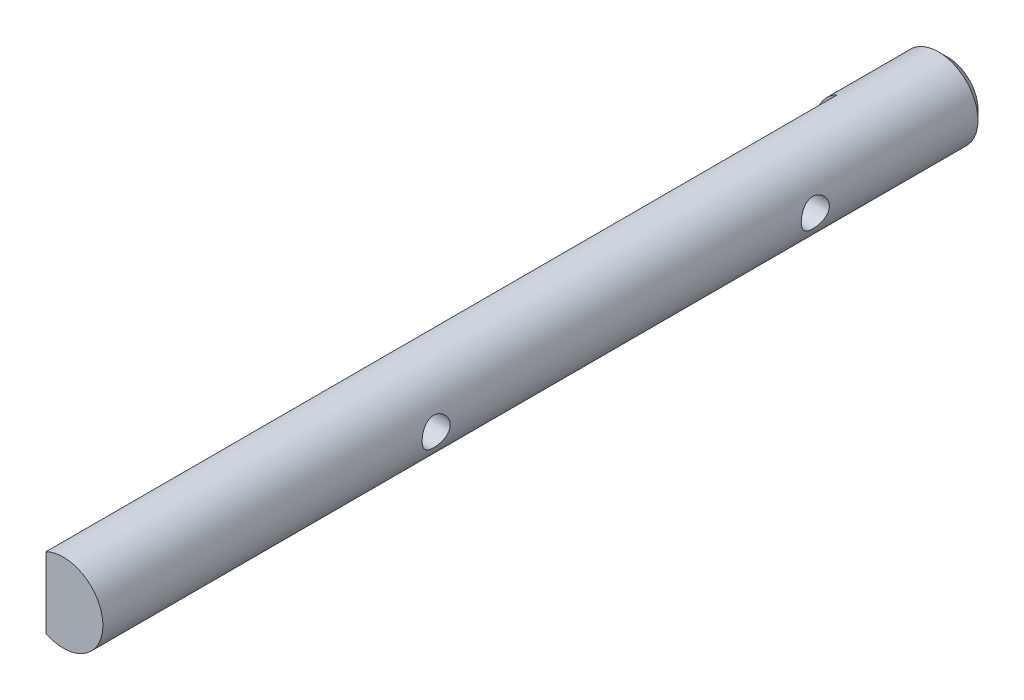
ISO-10303-21;
HEADER;
FILE_DESCRIPTION(('STEP AP214'),'2;1');
FILE_NAME('part.step','',(''),(''),'','','');
FILE_SCHEMA(('AUTOMOTIVE_DESIGN { 1 0 10303 214 1 1 1 1 }'));
ENDSEC;
DATA;
#1=APPLICATION_CONTEXT('core data for automotive mechanical design processes');
#2=APPLICATION_PROTOCOL_DEFINITION('international standard','automotive_design',2000,#1);
#3=PRODUCT_CONTEXT('',#1,'mechanical');
#4=PRODUCT('Part','Part','',(#3));
#5=PRODUCT_RELATED_PRODUCT_CATEGORY('part','',(#4));
#6=PRODUCT_DEFINITION_FORMATION('','',#4);
#7=PRODUCT_DEFINITION_CONTEXT('part definition',#1,'design');
#8=PRODUCT_DEFINITION('design','',#6,#7);
#9=PRODUCT_DEFINITION_SHAPE('','',#8);
#10=(LENGTH_UNIT() NAMED_UNIT(*) SI_UNIT(.MILLI.,.METRE.));
#11=(NAMED_UNIT(*) PLANE_ANGLE_UNIT() SI_UNIT($,.RADIAN.));
#12=(NAMED_UNIT(*) SI_UNIT($,.STERADIAN.) SOLID_ANGLE_UNIT());
#13=UNCERTAINTY_MEASURE_WITH_UNIT(LENGTH_MEASURE(1.E-05),#10,'distance_accuracy_value','');
#14=(GEOMETRIC_REPRESENTATION_CONTEXT(3) GLOBAL_UNCERTAINTY_ASSIGNED_CONTEXT((#13)) GLOBAL_UNIT_ASSIGNED_CONTEXT((#10,
#11,#12)) REPRESENTATION_CONTEXT('',''));
#15=CARTESIAN_POINT('',(0.,0.,0.));
#16=DIRECTION('',(0.,0.,1.));
#17=DIRECTION('',(1.,0.,0.));
#18=AXIS2_PLACEMENT_3D('',#15,#16,#17);
#19=CARTESIAN_POINT('',(0.,0.,160.02));
#20=DIRECTION('',(0.,0.,-1.));
#21=DIRECTION('',(-1.,0.,0.));
#22=AXIS2_PLACEMENT_3D('',#19,#20,#21);
#23=CYLINDRICAL_SURFACE('',#22,3.175);
#24=CARTESIAN_POINT('',(0.,0.,0.761999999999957));
#25=DIRECTION('',(0.,0.,1.));
#26=DIRECTION('',(1.,0.,0.));
#27=AXIS2_PLACEMENT_3D('',#24,#25,#26);
#28=CIRCLE('',#27,3.175);
#29=CARTESIAN_POINT('',(3.175,0.,0.761999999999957));
#30=VERTEX_POINT('',#29);
#31=EDGE_CURVE('E69',#30,#30,#28,.T.);
#32=ORIENTED_EDGE('',*,*,#31,.T.);
#33=EDGE_LOOP('',(#32));
#34=FACE_BOUND('',#33,.T.);
#35=CARTESIAN_POINT('',(3.175,0.,12.7127));
#36=CARTESIAN_POINT('',(3.17500087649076,-0.0614285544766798,12.7126987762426));
#37=CARTESIAN_POINT('',(3.17320130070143,-0.12284839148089,12.7177236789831));
#38=CARTESIAN_POINT('',(3.1662010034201,-0.243864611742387,12.7376185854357));
#39=CARTESIAN_POINT('',(3.16100038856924,-0.30346105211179,12.75248828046));
#40=CARTESIAN_POINT('',(3.14775949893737,-0.41906830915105,12.7914884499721));
#41=CARTESIAN_POINT('',(3.13972436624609,-0.47508540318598,12.8156021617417));
#42=CARTESIAN_POINT('',(3.12162393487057,-0.58227804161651,12.8723250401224));
#43=CARTESIAN_POINT('',(3.11155815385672,-0.633452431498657,12.9049362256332));
#44=CARTESIAN_POINT('',(3.09000790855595,-0.731495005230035,12.9790550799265));
#45=CARTESIAN_POINT('',(3.07848610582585,-0.778149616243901,13.0208343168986));
#46=CARTESIAN_POINT('',(3.055516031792,-0.863958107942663,13.1115265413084));
#47=CARTESIAN_POINT('',(3.04406778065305,-0.903110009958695,13.1604414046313));
#48=CARTESIAN_POINT('',(3.02211785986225,-0.974093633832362,13.266025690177));
#49=CARTESIAN_POINT('',(3.01166094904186,-1.00563502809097,13.3229005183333));
#50=CARTESIAN_POINT('',(2.99345244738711,-1.0586113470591,13.4415793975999));
#51=CARTESIAN_POINT('',(2.98569989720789,-1.0800498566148,13.5033816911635));
#52=CARTESIAN_POINT('',(2.9741742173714,-1.11138819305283,13.6277149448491));
#53=CARTESIAN_POINT('',(2.97026214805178,-1.12169236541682,13.6901306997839));
#54=CARTESIAN_POINT('',(2.96645158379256,-1.13173392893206,13.8159184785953));
#55=CARTESIAN_POINT('',(2.96655163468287,-1.13147514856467,13.8792901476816));
#56=CARTESIAN_POINT('',(2.97063328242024,-1.12070953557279,14.0016133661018));
#57=CARTESIAN_POINT('',(2.9744085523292,-1.11074743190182,14.0606209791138));
#58=CARTESIAN_POINT('',(2.98507483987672,-1.08175290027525,14.1760646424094));
#59=CARTESIAN_POINT('',(2.99196628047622,-1.06271924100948,14.2325003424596));
#60=CARTESIAN_POINT('',(3.00822311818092,-1.01579639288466,14.342367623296));
#61=CARTESIAN_POINT('',(3.01763009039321,-0.987756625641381,14.3957284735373));
#62=CARTESIAN_POINT('',(3.03784253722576,-0.923722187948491,14.497152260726));
#63=CARTESIAN_POINT('',(3.04864845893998,-0.887724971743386,14.5452134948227));
#64=CARTESIAN_POINT('',(3.0712342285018,-0.806247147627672,14.6377112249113));
#65=CARTESIAN_POINT('',(3.08303358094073,-0.760326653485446,14.6817563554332));
#66=CARTESIAN_POINT('',(3.10571393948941,-0.661610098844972,14.761630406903));
#67=CARTESIAN_POINT('',(3.11659483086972,-0.608813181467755,14.797458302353));
#68=CARTESIAN_POINT('',(3.13639217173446,-0.496923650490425,14.8602564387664));
#69=CARTESIAN_POINT('',(3.14528190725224,-0.437759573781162,14.8871083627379));
#70=CARTESIAN_POINT('',(3.15989936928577,-0.315359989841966,14.9303520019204));
#71=CARTESIAN_POINT('',(3.16562835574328,-0.252126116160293,14.9467478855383));
#72=CARTESIAN_POINT('',(3.17306329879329,-0.126684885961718,14.9678894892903));
#73=CARTESIAN_POINT('',(3.17495136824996,-0.0645771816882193,14.9731630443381));
#74=CARTESIAN_POINT('',(3.17504672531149,0.0596565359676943,14.9734316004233));
#75=CARTESIAN_POINT('',(3.1732547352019,0.12178254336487,14.9684286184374));
#76=CARTESIAN_POINT('',(3.16631168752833,0.242087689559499,14.9486955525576));
#77=CARTESIAN_POINT('',(3.16127656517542,0.300329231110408,14.9343009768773));
#78=CARTESIAN_POINT('',(3.14846933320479,0.413538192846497,14.89662458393));
#79=CARTESIAN_POINT('',(3.14069686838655,0.468505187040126,14.8733416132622));
#80=CARTESIAN_POINT('',(3.12292068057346,0.575332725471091,14.8178310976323));
#81=CARTESIAN_POINT('',(3.11286035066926,0.627062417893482,14.785370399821));
#82=CARTESIAN_POINT('',(3.09163517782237,0.724505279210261,14.7126939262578));
#83=CARTESIAN_POINT('',(3.08046995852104,0.770216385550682,14.6724755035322));
#84=CARTESIAN_POINT('',(3.05754963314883,0.8568118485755,14.582951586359));
#85=CARTESIAN_POINT('',(3.0457941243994,0.89732026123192,14.5332816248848));
#86=CARTESIAN_POINT('',(3.02359841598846,0.969488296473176,14.4276058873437));
#87=CARTESIAN_POINT('',(3.01315827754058,1.00114750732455,14.371599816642));
#88=CARTESIAN_POINT('',(2.99485112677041,1.0546547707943,14.2546072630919));
#89=CARTESIAN_POINT('',(2.98698641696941,1.07649405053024,14.1936163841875));
#90=CARTESIAN_POINT('',(2.97489781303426,1.1094694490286,14.0684703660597));
#91=CARTESIAN_POINT('',(2.97067196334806,1.1206113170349,14.0043169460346));
#92=CARTESIAN_POINT('',(2.96658222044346,1.13139068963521,13.8786943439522));
#93=CARTESIAN_POINT('',(2.96647835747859,1.13166111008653,13.8172867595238));
#94=CARTESIAN_POINT('',(2.97003931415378,1.12228164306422,13.6953511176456));
#95=CARTESIAN_POINT('',(2.97370384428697,1.11263251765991,13.6348229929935));
#96=CARTESIAN_POINT('',(2.98419839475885,1.08416089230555,13.5178729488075));
#97=CARTESIAN_POINT('',(2.99094779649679,1.06557142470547,13.4613864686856));
#98=CARTESIAN_POINT('',(3.0068123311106,1.01994372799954,13.352295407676));
#99=CARTESIAN_POINT('',(3.01592803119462,0.992903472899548,13.2996917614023));
#100=CARTESIAN_POINT('',(3.03604854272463,0.929616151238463,13.1970905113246));
#101=CARTESIAN_POINT('',(3.0471235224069,0.892986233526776,13.1473429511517));
#102=CARTESIAN_POINT('',(3.06964995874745,0.812177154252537,13.0544972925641));
#103=CARTESIAN_POINT('',(3.08110152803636,0.767995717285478,13.0114012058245));
#104=CARTESIAN_POINT('',(3.10373428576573,0.67086171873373,12.9310364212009));
#105=CARTESIAN_POINT('',(3.11487776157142,0.617595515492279,12.894134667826));
#106=CARTESIAN_POINT('',(3.13506244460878,0.505234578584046,12.8298345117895));
#107=CARTESIAN_POINT('',(3.14410383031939,0.446140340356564,12.8024353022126));
#108=CARTESIAN_POINT('',(3.15906443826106,0.323645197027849,12.7580664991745));
#109=CARTESIAN_POINT('',(3.16497811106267,0.260236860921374,12.7411154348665));
#110=CARTESIAN_POINT('',(3.17294468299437,0.131215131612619,12.7184349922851));
#111=CARTESIAN_POINT('',(3.17499906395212,0.0656025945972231,12.7127013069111));
#112=CARTESIAN_POINT('',(3.175,0.,12.7127));
#113=B_SPLINE_CURVE_WITH_KNOTS('',3,(#35,#36,#37,#38,#39,#40,#41,#42,#43,#44,#45,#46,#47,#48,
#49,#50,#51,#52,#53,#54,#55,#56,#57,#58,#59,#60,#61,#62,#63,#64,#65,#66,#67,#68,#69,#70,#71,#72,
#73,#74,#75,#76,#77,#78,#79,#80,#81,#82,#83,#84,#85,#86,#87,#88,#89,#90,#91,#92,#93,#94,#95,#96,
#97,#98,#99,#100,#101,#102,#103,#104,#105,#106,#107,#108,#109,#110,#111,#112),.UNSPECIFIED.,.T.,
.F.,(4,2,2,2,2,2,2,2,2,2,2,2,2,2,2,2,2,2,2,2,2,2,2,2,2,2,2,2,2,2,2,2,2,2,2,2,2,2,4),(0.,
0.184043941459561,0.368082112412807,0.551788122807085,0.735537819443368,0.925722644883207,
1.11595755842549,1.31258758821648,1.50914779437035,1.69830149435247,1.88738663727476,
2.06643452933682,2.24550673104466,2.42774410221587,2.61003985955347,2.80329006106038,
2.99656436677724,3.19229416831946,3.38794589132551,3.57408187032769,3.76018131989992,
3.93997181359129,4.1197856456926,4.30465683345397,4.4895912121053,4.68416822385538,
4.87875428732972,5.0735138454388,5.26816867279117,5.4514735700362,5.63476438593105,
5.81351722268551,5.99231294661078,6.17977826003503,6.36730015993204,6.56359488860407,
6.75987294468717,6.95649809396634,7.15304773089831),.UNSPECIFIED.);
#114=CARTESIAN_POINT('',(3.175,0.,12.7127));
#115=VERTEX_POINT('',#114);
#116=EDGE_CURVE('E81',#115,#115,#113,.T.);
#117=ORIENTED_EDGE('',*,*,#116,.T.);
#118=EDGE_LOOP('',(#117));
#119=FACE_BOUND('',#118,.T.);
#120=CARTESIAN_POINT('',(3.175,0.,43.1927));
#121=CARTESIAN_POINT('',(3.17500087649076,-0.0614285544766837,43.1926987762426));
#122=CARTESIAN_POINT('',(3.17320130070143,-0.122848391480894,43.1977236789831));
#123=CARTESIAN_POINT('',(3.1662010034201,-0.243864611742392,43.2176185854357));
#124=CARTESIAN_POINT('',(3.16100038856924,-0.303461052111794,43.23248828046));
#125=CARTESIAN_POINT('',(3.14775949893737,-0.419068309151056,43.2714884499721));
#126=CARTESIAN_POINT('',(3.13972436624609,-0.475085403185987,43.2956021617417));
#127=CARTESIAN_POINT('',(3.12162393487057,-0.582278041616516,43.3523250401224));
#128=CARTESIAN_POINT('',(3.11155815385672,-0.633452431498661,43.3849362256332));
#129=CARTESIAN_POINT('',(3.09000790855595,-0.73149500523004,43.4590550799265));
#130=CARTESIAN_POINT('',(3.07848610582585,-0.778149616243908,43.5008343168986));
#131=CARTESIAN_POINT('',(3.055516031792,-0.863958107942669,43.5915265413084));
#132=CARTESIAN_POINT('',(3.04406778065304,-0.903110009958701,43.6404414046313));
#133=CARTESIAN_POINT('',(3.02211785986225,-0.974093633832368,43.746025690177));
#134=CARTESIAN_POINT('',(3.01166094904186,-1.00563502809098,43.8029005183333));
#135=CARTESIAN_POINT('',(2.99345244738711,-1.05861134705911,43.9215793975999));
#136=CARTESIAN_POINT('',(2.98569989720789,-1.0800498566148,43.9833816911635));
#137=CARTESIAN_POINT('',(2.9741742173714,-1.11138819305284,44.1077149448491));
#138=CARTESIAN_POINT('',(2.97026214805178,-1.12169236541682,44.1701306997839));
#139=CARTESIAN_POINT('',(2.96645158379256,-1.13173392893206,44.2959184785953));
#140=CARTESIAN_POINT('',(2.96655163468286,-1.13147514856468,44.3592901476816));
#141=CARTESIAN_POINT('',(2.97063328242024,-1.12070953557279,44.4816133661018));
#142=CARTESIAN_POINT('',(2.9744085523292,-1.11074743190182,44.5406209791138));
#143=CARTESIAN_POINT('',(2.98507483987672,-1.08175290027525,44.6560646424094));
#144=CARTESIAN_POINT('',(2.99196628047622,-1.06271924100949,44.7125003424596));
#145=CARTESIAN_POINT('',(3.00822311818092,-1.01579639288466,44.822367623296));
#146=CARTESIAN_POINT('',(3.01763009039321,-0.987756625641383,44.8757284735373));
#147=CARTESIAN_POINT('',(3.03784253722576,-0.923722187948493,44.977152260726));
#148=CARTESIAN_POINT('',(3.04864845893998,-0.887724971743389,45.0252134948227));
#149=CARTESIAN_POINT('',(3.07123422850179,-0.806247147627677,45.1177112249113));
#150=CARTESIAN_POINT('',(3.08303358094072,-0.760326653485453,45.1617563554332));
#151=CARTESIAN_POINT('',(3.10571393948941,-0.661610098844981,45.241630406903));
#152=CARTESIAN_POINT('',(3.11659483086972,-0.608813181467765,45.277458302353));
#153=CARTESIAN_POINT('',(3.13639217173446,-0.496923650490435,45.3402564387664));
#154=CARTESIAN_POINT('',(3.14528190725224,-0.437759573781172,45.3671083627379));
#155=CARTESIAN_POINT('',(3.15989936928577,-0.315359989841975,45.4103520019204));
#156=CARTESIAN_POINT('',(3.16562835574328,-0.252126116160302,45.4267478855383));
#157=CARTESIAN_POINT('',(3.17306329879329,-0.126684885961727,45.4478894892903));
#158=CARTESIAN_POINT('',(3.17495136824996,-0.0645771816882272,45.4531630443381));
#159=CARTESIAN_POINT('',(3.17504672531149,0.0596565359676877,45.4534316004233));
#160=CARTESIAN_POINT('',(3.1732547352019,0.121782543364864,45.4484286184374));
#161=CARTESIAN_POINT('',(3.16631168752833,0.242087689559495,45.4286955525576));
#162=CARTESIAN_POINT('',(3.16127656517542,0.300329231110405,45.4143009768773));
#163=CARTESIAN_POINT('',(3.14846933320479,0.413538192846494,45.37662458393));
#164=CARTESIAN_POINT('',(3.14069686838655,0.468505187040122,45.3533416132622));
#165=CARTESIAN_POINT('',(3.12292068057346,0.575332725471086,45.2978310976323));
#166=CARTESIAN_POINT('',(3.11286035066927,0.627062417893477,45.265370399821));
#167=CARTESIAN_POINT('',(3.09163517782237,0.724505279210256,45.1926939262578));
#168=CARTESIAN_POINT('',(3.08046995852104,0.770216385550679,45.1524755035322));
#169=CARTESIAN_POINT('',(3.05754963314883,0.856811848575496,45.062951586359));
#170=CARTESIAN_POINT('',(3.0457941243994,0.897320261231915,45.0132816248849));
#171=CARTESIAN_POINT('',(3.02359841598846,0.969488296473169,44.9076058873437));
#172=CARTESIAN_POINT('',(3.01315827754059,1.00114750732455,44.851599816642));
#173=CARTESIAN_POINT('',(2.99485112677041,1.05465477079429,44.7346072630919));
#174=CARTESIAN_POINT('',(2.98698641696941,1.07649405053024,44.6736163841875));
#175=CARTESIAN_POINT('',(2.97489781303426,1.1094694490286,44.5484703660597));
#176=CARTESIAN_POINT('',(2.97067196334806,1.1206113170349,44.4843169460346));
#177=CARTESIAN_POINT('',(2.96658222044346,1.13139068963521,44.3586943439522));
#178=CARTESIAN_POINT('',(2.9664783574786,1.13166111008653,44.2972867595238));
#179=CARTESIAN_POINT('',(2.97003931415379,1.12228164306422,44.1753511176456));
#180=CARTESIAN_POINT('',(2.97370384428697,1.11263251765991,44.1148229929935));
#181=CARTESIAN_POINT('',(2.98419839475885,1.08416089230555,43.9978729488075));
#182=CARTESIAN_POINT('',(2.99094779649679,1.06557142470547,43.9413864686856));
#183=CARTESIAN_POINT('',(3.0068123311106,1.01994372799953,43.832295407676));
#184=CARTESIAN_POINT('',(3.01592803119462,0.992903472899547,43.7796917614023));
#185=CARTESIAN_POINT('',(3.03604854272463,0.929616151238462,43.6770905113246));
#186=CARTESIAN_POINT('',(3.0471235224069,0.892986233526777,43.6273429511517));
#187=CARTESIAN_POINT('',(3.06964995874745,0.812177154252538,43.5344972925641));
#188=CARTESIAN_POINT('',(3.08110152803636,0.767995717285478,43.4914012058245));
#189=CARTESIAN_POINT('',(3.10373428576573,0.670861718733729,43.4110364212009));
#190=CARTESIAN_POINT('',(3.11487776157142,0.617595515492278,43.374134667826));
#191=CARTESIAN_POINT('',(3.13506244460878,0.505234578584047,43.3098345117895));
#192=CARTESIAN_POINT('',(3.14410383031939,0.446140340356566,43.2824353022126));
#193=CARTESIAN_POINT('',(3.15906443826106,0.32364519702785,43.2380664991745));
#194=CARTESIAN_POINT('',(3.16497811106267,0.260236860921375,43.2211154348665));
#195=CARTESIAN_POINT('',(3.17294468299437,0.131215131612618,43.1984349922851));
#196=CARTESIAN_POINT('',(3.17499906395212,0.0656025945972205,43.1927013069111));
#197=CARTESIAN_POINT('',(3.175,0.,43.1927));
#198=B_SPLINE_CURVE_WITH_KNOTS('',3,(#120,#121,#122,#123,#124,#125,#126,#127,#128,#129,#130,
#131,#132,#133,#134,#135,#136,#137,#138,#139,#140,#141,#142,#143,#144,#145,#146,#147,#148,#149,
#150,#151,#152,#153,#154,#155,#156,#157,#158,#159,#160,#161,#162,#163,#164,#165,#166,#167,#168,
#169,#170,#171,#172,#173,#174,#175,#176,#177,#178,#179,#180,#181,#182,#183,#184,#185,#186,#187,
#188,#189,#190,#191,#192,#193,#194,#195,#196,#197),.UNSPECIFIED.,.T.,.F.,(4,2,2,2,2,2,2,2,2,2,2,
2,2,2,2,2,2,2,2,2,2,2,2,2,2,2,2,2,2,2,2,2,2,2,2,2,2,2,4),(0.,0.184043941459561,
0.368082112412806,0.551788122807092,0.735537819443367,0.925722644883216,1.11595755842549,
1.31258758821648,1.50914779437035,1.69830149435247,1.88738663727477,2.06643452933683,
2.24550673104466,2.42774410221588,2.61003985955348,2.80329006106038,2.99656436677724,
3.19229416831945,3.38794589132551,3.57408187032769,3.76018131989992,3.9399718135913,
4.11978564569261,4.30465683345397,4.48959121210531,4.68416822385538,4.87875428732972,
5.0735138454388,5.26816867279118,5.45147357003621,5.63476438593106,5.81351722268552,
5.99231294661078,6.17977826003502,6.36730015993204,6.56359488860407,6.75987294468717,
6.95649809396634,7.15304773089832),.UNSPECIFIED.);
#199=CARTESIAN_POINT('',(3.175,0.,43.1927));
#200=VERTEX_POINT('',#199);
#201=EDGE_CURVE('E87',#200,#200,#198,.T.);
#202=ORIENTED_EDGE('',*,*,#201,.T.);
#203=EDGE_LOOP('',(#202));
#204=FACE_BOUND('',#203,.T.);
#205=DIRECTION('',(0.,0.,-1.));
#206=VECTOR('',#205,1.);
#207=CARTESIAN_POINT('',(-1.397,2.85114292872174,160.02));
#208=LINE('',#207,#206);
#209=CARTESIAN_POINT('',(-1.397,2.85114292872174,71.12));
#210=VERTEX_POINT('',#209);
#211=CARTESIAN_POINT('',(-1.397,2.85114292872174,7.493));
#212=VERTEX_POINT('',#211);
#213=EDGE_CURVE('E63',#210,#212,#208,.T.);
#214=ORIENTED_EDGE('',*,*,#213,.F.);
#215=CARTESIAN_POINT('',(0.,0.,71.12));
#216=DIRECTION('',(0.,0.,-1.));
#217=DIRECTION('',(-1.,0.,0.));
#218=AXIS2_PLACEMENT_3D('',#215,#216,#217);
#219=CIRCLE('',#218,3.175);
#220=CARTESIAN_POINT('',(-1.397,-2.85114292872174,71.12));
#221=VERTEX_POINT('',#220);
#222=EDGE_CURVE('E44',#210,#221,#219,.T.);
#223=ORIENTED_EDGE('',*,*,#222,.T.);
#224=DIRECTION('',(0.,0.,-1.));
#225=VECTOR('',#224,1.);
#226=CARTESIAN_POINT('',(-1.397,-2.85114292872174,160.02));
#227=LINE('',#226,#225);
#228=CARTESIAN_POINT('',(-1.397,-2.85114292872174,7.493));
#229=VERTEX_POINT('',#228);
#230=EDGE_CURVE('E62',#229,#221,#227,.F.);
#231=ORIENTED_EDGE('',*,*,#230,.F.);
#232=CARTESIAN_POINT('',(0.,0.,7.493));
#233=DIRECTION('',(0.,0.,1.));
#234=DIRECTION('',(1.,0.,0.));
#235=AXIS2_PLACEMENT_3D('',#232,#233,#234);
#236=CIRCLE('',#235,3.175);
#237=EDGE_CURVE('E39',#212,#229,#236,.T.);
#238=ORIENTED_EDGE('',*,*,#237,.F.);
#239=EDGE_LOOP('',(#214,#223,#231,#238));
#240=FACE_BOUND('',#239,.T.);
#241=ADVANCED_FACE('F31',(#34,#119,#204,#240),#23,.T.);
#242=CARTESIAN_POINT('',(-3.175,0.,13.843));
#243=DIRECTION('',(1.,0.,0.));
#244=DIRECTION('',(0.,0.,-1.));
#245=AXIS2_PLACEMENT_3D('',#242,#243,#244);
#246=CYLINDRICAL_SURFACE('',#245,1.1303);
#247=ORIENTED_EDGE('',*,*,#116,.F.);
#248=EDGE_LOOP('',(#247));
#249=FACE_BOUND('',#248,.T.);
#250=CARTESIAN_POINT('',(-1.397,0.,13.843));
#251=DIRECTION('',(-1.,0.,0.));
#252=DIRECTION('',(0.,0.,1.));
#253=AXIS2_PLACEMENT_3D('',#250,#251,#252);
#254=CIRCLE('',#253,1.1303);
#255=CARTESIAN_POINT('',(-1.397,0.,14.9733));
#256=VERTEX_POINT('',#255);
#257=EDGE_CURVE('E67',#256,#256,#254,.F.);
#258=ORIENTED_EDGE('',*,*,#257,.F.);
#259=EDGE_LOOP('',(#258));
#260=FACE_BOUND('',#259,.T.);
#261=ADVANCED_FACE('F93',(#249,#260),#246,.F.);
#262=CARTESIAN_POINT('',(-3.175,0.,44.323));
#263=DIRECTION('',(1.,0.,0.));
#264=DIRECTION('',(0.,0.,-1.));
#265=AXIS2_PLACEMENT_3D('',#262,#263,#264);
#266=CYLINDRICAL_SURFACE('',#265,1.1303);
#267=ORIENTED_EDGE('',*,*,#201,.F.);
#268=EDGE_LOOP('',(#267));
#269=FACE_BOUND('',#268,.T.);
#270=CARTESIAN_POINT('',(-1.397,0.,44.323));
#271=DIRECTION('',(-1.,0.,0.));
#272=DIRECTION('',(0.,0.,1.));
#273=AXIS2_PLACEMENT_3D('',#270,#271,#272);
#274=CIRCLE('',#273,1.1303);
#275=CARTESIAN_POINT('',(-1.397,0.,45.4533));
#276=VERTEX_POINT('',#275);
#277=EDGE_CURVE('E72',#276,#276,#274,.F.);
#278=ORIENTED_EDGE('',*,*,#277,.F.);
#279=EDGE_LOOP('',(#278));
#280=FACE_BOUND('',#279,.T.);
#281=ADVANCED_FACE('F96',(#269,#280),#266,.F.);
#282=CARTESIAN_POINT('',(0.,0.,0.));
#283=DIRECTION('',(0.,0.,1.));
#284=DIRECTION('',(1.,0.,0.));
#285=AXIS2_PLACEMENT_3D('',#282,#283,#284);
#286=PLANE('',#285);
#287=CARTESIAN_POINT('',(0.,0.,0.));
#288=DIRECTION('',(0.,0.,1.));
#289=DIRECTION('',(1.,0.,0.));
#290=AXIS2_PLACEMENT_3D('',#287,#288,#289);
#291=CIRCLE('',#290,2.41300000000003);
#292=CARTESIAN_POINT('',(2.41300000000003,0.,0.));
#293=VERTEX_POINT('',#292);
#294=EDGE_CURVE('E78',#293,#293,#291,.F.);
#295=ORIENTED_EDGE('',*,*,#294,.T.);
#296=EDGE_LOOP('',(#295));
#297=FACE_BOUND('',#296,.T.);
#298=ADVANCED_FACE('F100',(#297),#286,.F.);
#299=CARTESIAN_POINT('',(0.,0.,0.761999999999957));
#300=DIRECTION('',(0.,0.,1.));
#301=DIRECTION('',(1.,0.,0.));
#302=AXIS2_PLACEMENT_3D('',#299,#300,#301);
#303=CONICAL_SURFACE('',#302,3.175,0.785398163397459);
#304=ORIENTED_EDGE('',*,*,#294,.F.);
#305=EDGE_LOOP('',(#304));
#306=FACE_BOUND('',#305,.T.);
#307=ORIENTED_EDGE('',*,*,#31,.F.);
#308=EDGE_LOOP('',(#307));
#309=FACE_BOUND('',#308,.T.);
#310=ADVANCED_FACE('F33',(#306,#309),#303,.T.);
#311=CARTESIAN_POINT('',(-1.397,3.175,7.493));
#312=DIRECTION('',(0.,0.,1.));
#313=DIRECTION('',(1.,0.,0.));
#314=AXIS2_PLACEMENT_3D('',#311,#312,#313);
#315=PLANE('',#314);
#316=DIRECTION('',(0.,1.,0.));
#317=VECTOR('',#316,1.);
#318=CARTESIAN_POINT('',(-1.397,3.175,7.493));
#319=LINE('',#318,#317);
#320=EDGE_CURVE('E52',#229,#212,#319,.T.);
#321=ORIENTED_EDGE('',*,*,#320,.T.);
#322=ORIENTED_EDGE('',*,*,#237,.T.);
#323=EDGE_LOOP('',(#321,#322));
#324=FACE_BOUND('',#323,.T.);
#325=ADVANCED_FACE('F107',(#324),#315,.T.);
#326=CARTESIAN_POINT('',(-1.397,-3.175,7.493));
#327=DIRECTION('',(-1.,0.,0.));
#328=DIRECTION('',(0.,0.,1.));
#329=AXIS2_PLACEMENT_3D('',#326,#327,#328);
#330=PLANE('',#329);
#331=DIRECTION('',(0.,-1.,0.));
#332=VECTOR('',#331,1.);
#333=CARTESIAN_POINT('',(-1.397,-3.175,71.12));
#334=LINE('',#333,#332);
#335=EDGE_CURVE('E11',#210,#221,#334,.T.);
#336=ORIENTED_EDGE('',*,*,#335,.F.);
#337=ORIENTED_EDGE('',*,*,#213,.T.);
#338=ORIENTED_EDGE('',*,*,#320,.F.);
#339=ORIENTED_EDGE('',*,*,#230,.T.);
#340=EDGE_LOOP('',(#336,#337,#338,#339));
#341=FACE_BOUND('',#340,.T.);
#342=ORIENTED_EDGE('',*,*,#277,.T.);
#343=EDGE_LOOP('',(#342));
#344=FACE_BOUND('',#343,.T.);
#345=ORIENTED_EDGE('',*,*,#257,.T.);
#346=EDGE_LOOP('',(#345));
#347=FACE_BOUND('',#346,.T.);
#348=ADVANCED_FACE('F65',(#341,#344,#347),#330,.T.);
#349=CARTESIAN_POINT('',(0.,0.,71.12));
#350=DIRECTION('',(0.,0.,-1.));
#351=DIRECTION('',(-1.,0.,0.));
#352=AXIS2_PLACEMENT_3D('',#349,#350,#351);
#353=PLANE('',#352);
#354=ORIENTED_EDGE('',*,*,#335,.T.);
#355=ORIENTED_EDGE('',*,*,#222,.F.);
#356=EDGE_LOOP('',(#354,#355));
#357=FACE_BOUND('',#356,.T.);
#358=ADVANCED_FACE('F57',(#357),#353,.F.);
#359=CLOSED_SHELL('',(#241,#261,#281,#298,#310,#325,#348,#358));
#360=MANIFOLD_SOLID_BREP('B2',#359);
#361=ADVANCED_BREP_SHAPE_REPRESENTATION('',(#18,#360),#14);
#362=SHAPE_DEFINITION_REPRESENTATION(#9,#361);
ENDSEC;
END-ISO-10303-21;
